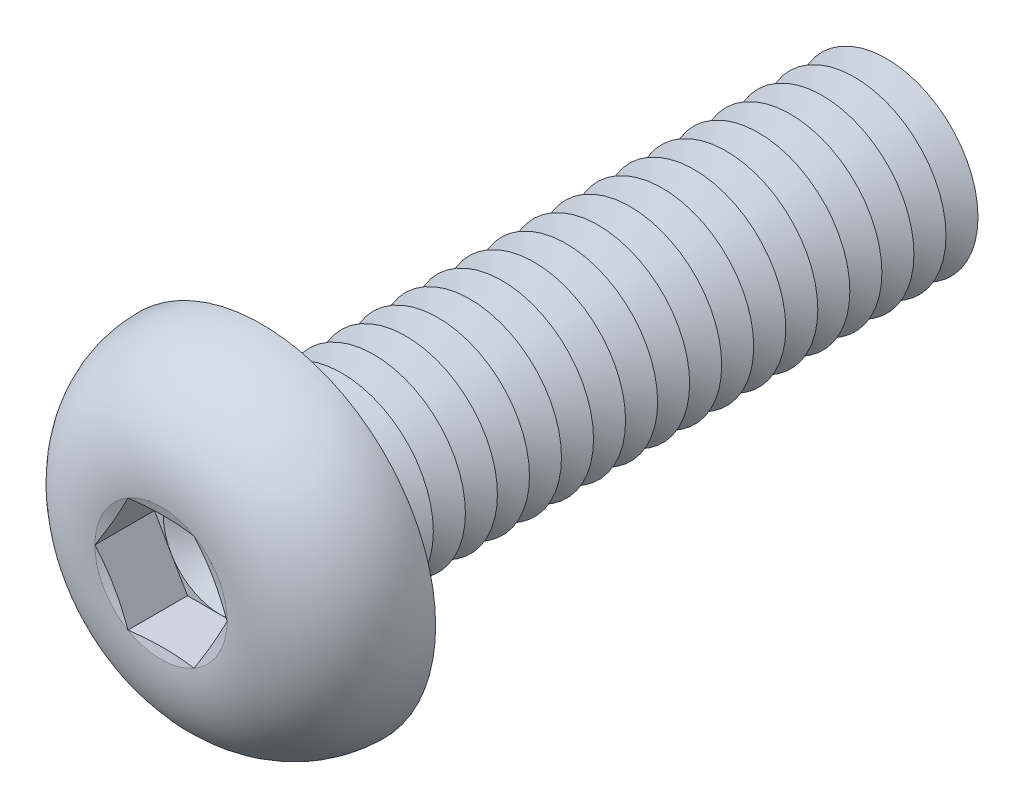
from build123d import *

# Parameters (mm, degrees)
FILLET1_R          = 0.35
LPATTERN1_COUNT    = 20
LPATTERN1_PITCH    = 0.7
CUT_EXTRUDE1_DEPTH = 1.3


with BuildPart() as part:
    # Sketch1 → Revolve1 (revolve)
    with BuildSketch(Plane(origin=(0, 0, 0), x_dir=(0, 0, -1), z_dir=(1, 0, 0)), mode=Mode.PRIVATE) as revolve1_sk:
        with BuildLine():
            Line((0, 2), (0, 3.8))
            ThreePointArc((0, 3.8), (-1.611961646, 3.099623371), (-2.2, 1.443375))
            Line((-2.2, 1.443375), (-2.006624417, 0.7216875))
            Line((-2.006624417, 0.7216875), (-2.2, 0.7216875))
            Line((-2.2, 0.7216875), (-2.2, 0))
            Line((-2.2, 0), (14, 0))
            Line((14, 0), (14, 2))
            Line((14, 2), (0, 2))
        make_face()
    revolve(revolve1_sk.sketch.rotate(Axis((0, 0, -14), (0, 0, 1)), 90), axis=Axis((0, 0, -14), (0, 0, 1)))

    # Fillet1
    fillet1_edges = [part.edges().sort_by_distance(p)[0] for p in [
        (2, 0, 0),
    ]]
    fillet(fillet1_edges, radius=FILLET1_R)

    # Sketch2 → Cut-Revolve1 (revolve, cut)
    with BuildSketch(Plane(origin=(0, 0, 0), x_dir=(0, 0, -1), z_dir=(1, 0, 0)), mode=Mode.PRIVATE) as cut_revolve1_sk:
        Polygon((13.65, 2), (14.35, 2), (14, 1.393782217), align=None)
    cut_revolve1 = revolve(cut_revolve1_sk.sketch.rotate(Axis((0, 0, -14), (0, 0, -1)), 270), axis=Axis((0, 0, -14), (0, 0, -1)), mode=Mode.SUBTRACT)

    # LPattern1: Cut-Revolve1 ×20
    with Locations(*[(0, 0, i * LPATTERN1_PITCH) for i in range(1, LPATTERN1_COUNT)]):
        add(cut_revolve1, mode=Mode.SUBTRACT)

    # Sketch3 → Cut-Extrude1 (cut)
    with BuildSketch(Plane.XY.offset(2.2)):
        Polygon((0.7216875, 1.249999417), (-0.7216875, 1.249999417), (-1.443375, 0), (-0.7216875, -1.249999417), (0.7216875, -1.249999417), (1.443375, 0), align=None)
    extrude(amount=-CUT_EXTRUDE1_DEPTH, mode=Mode.SUBTRACT)

    # Cut-Extrude2 cone 1 section (on through the dimple's axis) → Cut-Extrude2 (revolve, cut)
    with BuildSketch(Plane(origin=(0, 0, 0.9), x_dir=(0, -1, 0), z_dir=(1, 0, 0))):
        Polygon((0, 0), (1.249999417, 0), (0, 0.7216875), align=None)
    revolve(axis=Axis((0, 0, 0.9), (0, 0, -1)), mode=Mode.SUBTRACT)


solid = part.part
